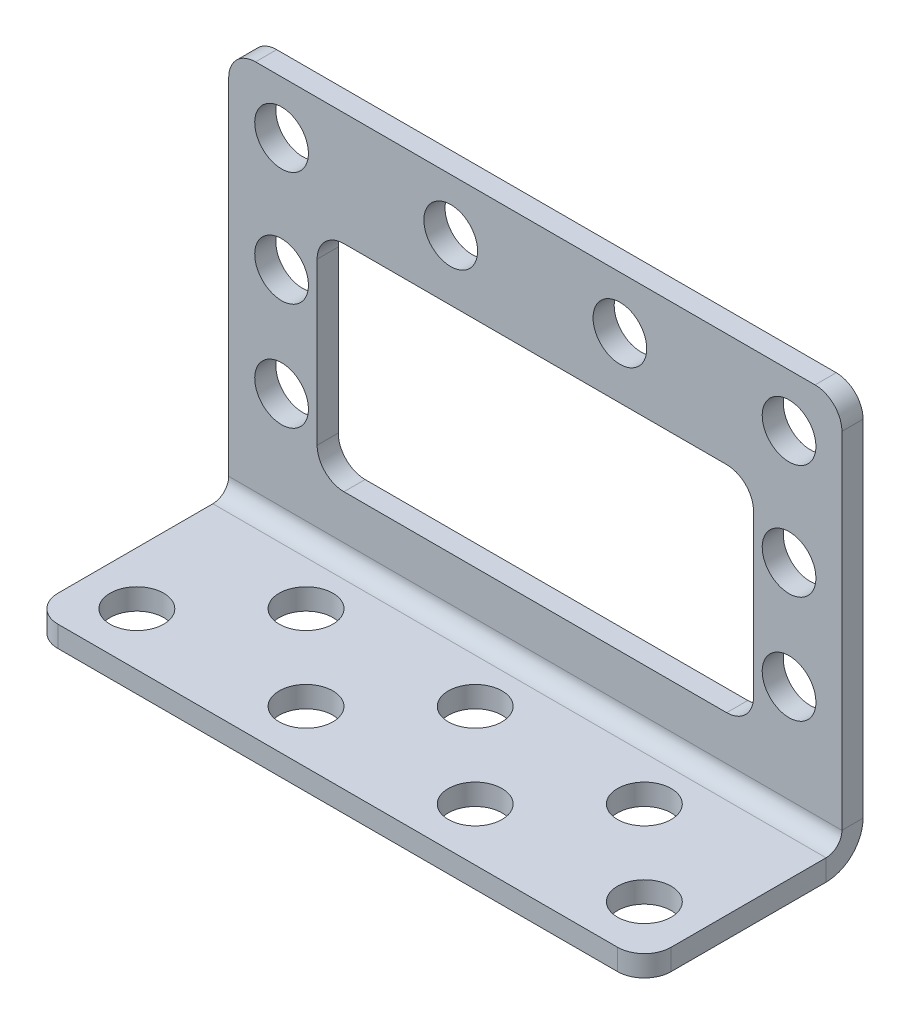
ISO-10303-21;
HEADER;
FILE_DESCRIPTION(('STEP AP214'),'2;1');
FILE_NAME('part.step','',(''),(''),'','','');
FILE_SCHEMA(('AUTOMOTIVE_DESIGN { 1 0 10303 214 1 1 1 1 }'));
ENDSEC;
DATA;
#1=APPLICATION_CONTEXT('core data for automotive mechanical design processes');
#2=APPLICATION_PROTOCOL_DEFINITION('international standard','automotive_design',2000,#1);
#3=PRODUCT_CONTEXT('',#1,'mechanical');
#4=PRODUCT('Part','Part','',(#3));
#5=PRODUCT_RELATED_PRODUCT_CATEGORY('part','',(#4));
#6=PRODUCT_DEFINITION_FORMATION('','',#4);
#7=PRODUCT_DEFINITION_CONTEXT('part definition',#1,'design');
#8=PRODUCT_DEFINITION('design','',#6,#7);
#9=PRODUCT_DEFINITION_SHAPE('','',#8);
#10=(LENGTH_UNIT() NAMED_UNIT(*) SI_UNIT(.MILLI.,.METRE.));
#11=(NAMED_UNIT(*) PLANE_ANGLE_UNIT() SI_UNIT($,.RADIAN.));
#12=(NAMED_UNIT(*) SI_UNIT($,.STERADIAN.) SOLID_ANGLE_UNIT());
#13=UNCERTAINTY_MEASURE_WITH_UNIT(LENGTH_MEASURE(1.E-05),#10,'distance_accuracy_value','');
#14=(GEOMETRIC_REPRESENTATION_CONTEXT(3) GLOBAL_UNCERTAINTY_ASSIGNED_CONTEXT((#13)) GLOBAL_UNIT_ASSIGNED_CONTEXT((#10,
#11,#12)) REPRESENTATION_CONTEXT('',''));
#15=CARTESIAN_POINT('',(0.,0.,0.));
#16=DIRECTION('',(0.,0.,1.));
#17=DIRECTION('',(1.,0.,0.));
#18=AXIS2_PLACEMENT_3D('',#15,#16,#17);
#19=CARTESIAN_POINT('',(-29.,36.1772040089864,16.7734954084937));
#20=DIRECTION('',(1.,0.,0.));
#21=DIRECTION('',(0.,1.,0.));
#22=AXIS2_PLACEMENT_3D('',#19,#20,#21);
#23=PLANE('',#22);
#24=DIRECTION('',(0.,-1.,0.));
#25=VECTOR('',#24,1.);
#26=CARTESIAN_POINT('',(-29.,36.1772040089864,14.7734954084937));
#27=LINE('',#26,#25);
#28=CARTESIAN_POINT('',(-29.,36.1772040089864,14.7734954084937));
#29=VERTEX_POINT('',#28);
#30=CARTESIAN_POINT('',(-29.,3.50000000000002,14.7734954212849));
#31=VERTEX_POINT('',#30);
#32=EDGE_CURVE('E215',#29,#31,#27,.T.);
#33=ORIENTED_EDGE('',*,*,#32,.T.);
#34=DIRECTION('',(0.,0.,1.));
#35=VECTOR('',#34,1.);
#36=CARTESIAN_POINT('',(-29.,3.50000000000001,16.7734954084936));
#37=LINE('',#36,#35);
#38=CARTESIAN_POINT('',(-29.,3.50000000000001,16.7734954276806));
#39=VERTEX_POINT('',#38);
#40=EDGE_CURVE('E187',#31,#39,#37,.T.);
#41=ORIENTED_EDGE('',*,*,#40,.T.);
#42=DIRECTION('',(0.,-1.,0.));
#43=VECTOR('',#42,1.);
#44=CARTESIAN_POINT('',(-29.,36.1772040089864,16.7734954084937));
#45=LINE('',#44,#43);
#46=CARTESIAN_POINT('',(-29.,36.1772040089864,16.7734954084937));
#47=VERTEX_POINT('',#46);
#48=EDGE_CURVE('E46',#47,#39,#45,.T.);
#49=ORIENTED_EDGE('',*,*,#48,.F.);
#50=DIRECTION('',(0.,0.,-1.));
#51=VECTOR('',#50,1.);
#52=CARTESIAN_POINT('',(-29.,36.1772040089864,16.7734954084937));
#53=LINE('',#52,#51);
#54=EDGE_CURVE('E212',#47,#29,#53,.T.);
#55=ORIENTED_EDGE('',*,*,#54,.T.);
#56=EDGE_LOOP('',(#33,#41,#49,#55));
#57=FACE_BOUND('',#56,.T.);
#58=ADVANCED_FACE('F42',(#57),#23,.F.);
#59=CARTESIAN_POINT('',(29.,36.1772040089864,16.7734954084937));
#60=DIRECTION('',(-1.,0.,0.));
#61=DIRECTION('',(0.,-1.,0.));
#62=AXIS2_PLACEMENT_3D('',#59,#60,#61);
#63=PLANE('',#62);
#64=DIRECTION('',(0.,1.,0.));
#65=VECTOR('',#64,1.);
#66=CARTESIAN_POINT('',(29.,36.1772040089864,16.7734954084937));
#67=LINE('',#66,#65);
#68=CARTESIAN_POINT('',(29.,3.50000000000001,16.7734954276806));
#69=VERTEX_POINT('',#68);
#70=CARTESIAN_POINT('',(29.,36.1772040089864,16.7734954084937));
#71=VERTEX_POINT('',#70);
#72=EDGE_CURVE('E224',#69,#71,#67,.T.);
#73=ORIENTED_EDGE('',*,*,#72,.F.);
#74=DIRECTION('',(0.,0.,-1.));
#75=VECTOR('',#74,1.);
#76=CARTESIAN_POINT('',(29.,3.50000000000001,16.7734954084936));
#77=LINE('',#76,#75);
#78=CARTESIAN_POINT('',(29.,3.50000000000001,14.7734954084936));
#79=VERTEX_POINT('',#78);
#80=EDGE_CURVE('E12',#69,#79,#77,.T.);
#81=ORIENTED_EDGE('',*,*,#80,.T.);
#82=DIRECTION('',(0.,1.,0.));
#83=VECTOR('',#82,1.);
#84=CARTESIAN_POINT('',(29.,36.1772040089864,14.7734954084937));
#85=LINE('',#84,#83);
#86=CARTESIAN_POINT('',(29.,36.1772040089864,14.7734954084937));
#87=VERTEX_POINT('',#86);
#88=EDGE_CURVE('E220',#79,#87,#85,.T.);
#89=ORIENTED_EDGE('',*,*,#88,.T.);
#90=DIRECTION('',(0.,0.,-1.));
#91=VECTOR('',#90,1.);
#92=CARTESIAN_POINT('',(29.,36.1772040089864,16.7734954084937));
#93=LINE('',#92,#91);
#94=EDGE_CURVE('E203',#71,#87,#93,.T.);
#95=ORIENTED_EDGE('',*,*,#94,.F.);
#96=EDGE_LOOP('',(#73,#81,#89,#95));
#97=FACE_BOUND('',#96,.T.);
#98=ADVANCED_FACE('F44',(#97),#63,.F.);
#99=CARTESIAN_POINT('',(26.46,-15.0734954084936,16.7734954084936));
#100=DIRECTION('',(0.,0.,-1.));
#101=DIRECTION('',(0.,1.,0.));
#102=AXIS2_PLACEMENT_3D('',#99,#100,#101);
#103=PLANE('',#102);
#104=CARTESIAN_POINT('',(24.,33.7172040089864,16.7734954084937));
#105=DIRECTION('',(0.,0.,1.));
#106=DIRECTION('',(0.,-1.,0.));
#107=AXIS2_PLACEMENT_3D('',#104,#105,#106);
#108=CIRCLE('',#107,2.54);
#109=CARTESIAN_POINT('',(24.,31.1772040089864,16.7734954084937));
#110=VERTEX_POINT('',#109);
#111=EDGE_CURVE('E293',#110,#110,#108,.T.);
#112=ORIENTED_EDGE('',*,*,#111,.F.);
#113=EDGE_LOOP('',(#112));
#114=FACE_BOUND('',#113,.T.);
#115=CARTESIAN_POINT('',(-24.,12.7665045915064,16.7734954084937));
#116=DIRECTION('',(0.,0.,1.));
#117=DIRECTION('',(0.,-1.,0.));
#118=AXIS2_PLACEMENT_3D('',#115,#116,#117);
#119=CIRCLE('',#118,2.54);
#120=CARTESIAN_POINT('',(-24.,10.2265045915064,16.7734954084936));
#121=VERTEX_POINT('',#120);
#122=EDGE_CURVE('E297',#121,#121,#119,.T.);
#123=ORIENTED_EDGE('',*,*,#122,.F.);
#124=EDGE_LOOP('',(#123));
#125=FACE_BOUND('',#124,.T.);
#126=CARTESIAN_POINT('',(-24.,22.9265045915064,16.7734954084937));
#127=DIRECTION('',(0.,0.,1.));
#128=DIRECTION('',(0.,-1.,0.));
#129=AXIS2_PLACEMENT_3D('',#126,#127,#128);
#130=CIRCLE('',#129,2.54);
#131=CARTESIAN_POINT('',(-24.,20.3865045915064,16.7734954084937));
#132=VERTEX_POINT('',#131);
#133=EDGE_CURVE('E301',#132,#132,#130,.T.);
#134=ORIENTED_EDGE('',*,*,#133,.F.);
#135=EDGE_LOOP('',(#134));
#136=FACE_BOUND('',#135,.T.);
#137=CARTESIAN_POINT('',(-8.,33.7172040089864,16.7734954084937));
#138=DIRECTION('',(0.,0.,1.));
#139=DIRECTION('',(0.,-1.,0.));
#140=AXIS2_PLACEMENT_3D('',#137,#138,#139);
#141=CIRCLE('',#140,2.54);
#142=CARTESIAN_POINT('',(-8.,31.1772040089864,16.7734954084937));
#143=VERTEX_POINT('',#142);
#144=EDGE_CURVE('E305',#143,#143,#141,.T.);
#145=ORIENTED_EDGE('',*,*,#144,.F.);
#146=EDGE_LOOP('',(#145));
#147=FACE_BOUND('',#146,.T.);
#148=CARTESIAN_POINT('',(-18.0975,25.4665045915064,16.7734954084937));
#149=DIRECTION('',(0.,0.,1.));
#150=DIRECTION('',(0.,1.,0.));
#151=AXIS2_PLACEMENT_3D('',#148,#149,#150);
#152=CIRCLE('',#151,2.54);
#153=CARTESIAN_POINT('',(-18.0975,28.0065045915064,16.7734954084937));
#154=VERTEX_POINT('',#153);
#155=CARTESIAN_POINT('',(-20.6375,25.4665045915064,16.7734954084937));
#156=VERTEX_POINT('',#155);
#157=EDGE_CURVE('E310',#154,#156,#152,.T.);
#158=ORIENTED_EDGE('',*,*,#157,.F.);
#159=DIRECTION('',(-1.,0.,0.));
#160=VECTOR('',#159,1.);
#161=CARTESIAN_POINT('',(-18.0975,28.0065045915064,16.7734954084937));
#162=LINE('',#161,#160);
#163=CARTESIAN_POINT('',(18.0975,28.0065045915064,16.7734954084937));
#164=VERTEX_POINT('',#163);
#165=EDGE_CURVE('E379',#164,#154,#162,.T.);
#166=ORIENTED_EDGE('',*,*,#165,.F.);
#167=CARTESIAN_POINT('',(18.0975,25.4665045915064,16.7734954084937));
#168=DIRECTION('',(0.,0.,1.));
#169=DIRECTION('',(0.,-1.,0.));
#170=AXIS2_PLACEMENT_3D('',#167,#168,#169);
#171=CIRCLE('',#170,2.54);
#172=CARTESIAN_POINT('',(20.6375,25.4665045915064,16.7734954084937));
#173=VERTEX_POINT('',#172);
#174=EDGE_CURVE('E377',#173,#164,#171,.T.);
#175=ORIENTED_EDGE('',*,*,#174,.F.);
#176=DIRECTION('',(0.,1.,0.));
#177=VECTOR('',#176,1.);
#178=CARTESIAN_POINT('',(20.6375,10.2265045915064,16.7734954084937));
#179=LINE('',#178,#177);
#180=CARTESIAN_POINT('',(20.6375,10.2265045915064,16.7734954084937));
#181=VERTEX_POINT('',#180);
#182=EDGE_CURVE('E375',#181,#173,#179,.T.);
#183=ORIENTED_EDGE('',*,*,#182,.F.);
#184=CARTESIAN_POINT('',(18.0975,10.2265045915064,16.7734954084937));
#185=DIRECTION('',(0.,0.,1.));
#186=DIRECTION('',(0.,-1.,0.));
#187=AXIS2_PLACEMENT_3D('',#184,#185,#186);
#188=CIRCLE('',#187,2.54);
#189=CARTESIAN_POINT('',(18.0975,7.68650459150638,16.7734954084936));
#190=VERTEX_POINT('',#189);
#191=EDGE_CURVE('E373',#190,#181,#188,.T.);
#192=ORIENTED_EDGE('',*,*,#191,.F.);
#193=DIRECTION('',(1.,0.,0.));
#194=VECTOR('',#193,1.);
#195=CARTESIAN_POINT('',(-18.0975,7.68650459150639,16.7734954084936));
#196=LINE('',#195,#194);
#197=CARTESIAN_POINT('',(-18.0975,7.68650459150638,16.7734954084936));
#198=VERTEX_POINT('',#197);
#199=EDGE_CURVE('E371',#198,#190,#196,.T.);
#200=ORIENTED_EDGE('',*,*,#199,.F.);
#201=CARTESIAN_POINT('',(-18.0975,10.2265045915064,16.7734954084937));
#202=DIRECTION('',(0.,0.,1.));
#203=DIRECTION('',(0.,1.,0.));
#204=AXIS2_PLACEMENT_3D('',#201,#202,#203);
#205=CIRCLE('',#204,2.54);
#206=CARTESIAN_POINT('',(-20.6375,10.2265045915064,16.7734954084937));
#207=VERTEX_POINT('',#206);
#208=EDGE_CURVE('E369',#207,#198,#205,.T.);
#209=ORIENTED_EDGE('',*,*,#208,.F.);
#210=DIRECTION('',(0.,-1.,0.));
#211=VECTOR('',#210,1.);
#212=CARTESIAN_POINT('',(-20.6375,10.2265045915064,16.7734954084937));
#213=LINE('',#212,#211);
#214=EDGE_CURVE('E366',#156,#207,#213,.T.);
#215=ORIENTED_EDGE('',*,*,#214,.F.);
#216=EDGE_LOOP('',(#158,#166,#175,#183,#192,#200,#209,#215));
#217=FACE_BOUND('',#216,.T.);
#218=CARTESIAN_POINT('',(8.,33.7172040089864,16.7734954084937));
#219=DIRECTION('',(0.,0.,1.));
#220=DIRECTION('',(0.,-1.,0.));
#221=AXIS2_PLACEMENT_3D('',#218,#219,#220);
#222=CIRCLE('',#221,2.54);
#223=CARTESIAN_POINT('',(8.,31.1772040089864,16.7734954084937));
#224=VERTEX_POINT('',#223);
#225=EDGE_CURVE('E314',#224,#224,#222,.T.);
#226=ORIENTED_EDGE('',*,*,#225,.F.);
#227=EDGE_LOOP('',(#226));
#228=FACE_BOUND('',#227,.T.);
#229=CARTESIAN_POINT('',(24.,22.9265045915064,16.7734954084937));
#230=DIRECTION('',(0.,0.,1.));
#231=DIRECTION('',(0.,-1.,0.));
#232=AXIS2_PLACEMENT_3D('',#229,#230,#231);
#233=CIRCLE('',#232,2.54);
#234=CARTESIAN_POINT('',(24.,20.3865045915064,16.7734954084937));
#235=VERTEX_POINT('',#234);
#236=EDGE_CURVE('E318',#235,#235,#233,.T.);
#237=ORIENTED_EDGE('',*,*,#236,.F.);
#238=EDGE_LOOP('',(#237));
#239=FACE_BOUND('',#238,.T.);
#240=CARTESIAN_POINT('',(24.,12.7665045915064,16.7734954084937));
#241=DIRECTION('',(0.,0.,1.));
#242=DIRECTION('',(0.,-1.,0.));
#243=AXIS2_PLACEMENT_3D('',#240,#241,#242);
#244=CIRCLE('',#243,2.54);
#245=CARTESIAN_POINT('',(24.,10.2265045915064,16.7734954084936));
#246=VERTEX_POINT('',#245);
#247=EDGE_CURVE('E322',#246,#246,#244,.T.);
#248=ORIENTED_EDGE('',*,*,#247,.F.);
#249=EDGE_LOOP('',(#248));
#250=FACE_BOUND('',#249,.T.);
#251=CARTESIAN_POINT('',(-24.,33.7172040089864,16.7734954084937));
#252=DIRECTION('',(0.,0.,1.));
#253=DIRECTION('',(0.,-1.,0.));
#254=AXIS2_PLACEMENT_3D('',#251,#252,#253);
#255=CIRCLE('',#254,2.54);
#256=CARTESIAN_POINT('',(-24.,31.1772040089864,16.7734954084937));
#257=VERTEX_POINT('',#256);
#258=EDGE_CURVE('E325',#257,#257,#255,.T.);
#259=ORIENTED_EDGE('',*,*,#258,.F.);
#260=EDGE_LOOP('',(#259));
#261=FACE_BOUND('',#260,.T.);
#262=ORIENTED_EDGE('',*,*,#48,.T.);
#263=DIRECTION('',(1.,0.,0.));
#264=VECTOR('',#263,1.);
#265=CARTESIAN_POINT('',(26.46,3.50000000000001,16.7734954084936));
#266=LINE('',#265,#264);
#267=EDGE_CURVE('E197',#39,#69,#266,.T.);
#268=ORIENTED_EDGE('',*,*,#267,.T.);
#269=ORIENTED_EDGE('',*,*,#72,.T.);
#270=CARTESIAN_POINT('',(26.46,36.1772040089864,16.7734954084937));
#271=DIRECTION('',(0.,0.,1.));
#272=DIRECTION('',(0.,-1.,0.));
#273=AXIS2_PLACEMENT_3D('',#270,#271,#272);
#274=CIRCLE('',#273,2.54);
#275=CARTESIAN_POINT('',(26.46,38.7172040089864,16.7734954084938));
#276=VERTEX_POINT('',#275);
#277=EDGE_CURVE('E226',#71,#276,#274,.T.);
#278=ORIENTED_EDGE('',*,*,#277,.T.);
#279=DIRECTION('',(-1.,0.,0.));
#280=VECTOR('',#279,1.);
#281=CARTESIAN_POINT('',(-26.46,38.7172040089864,16.7734954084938));
#282=LINE('',#281,#280);
#283=CARTESIAN_POINT('',(-26.46,38.7172040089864,16.7734954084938));
#284=VERTEX_POINT('',#283);
#285=EDGE_CURVE('E228',#276,#284,#282,.T.);
#286=ORIENTED_EDGE('',*,*,#285,.T.);
#287=CARTESIAN_POINT('',(-26.46,36.1772040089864,16.7734954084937));
#288=DIRECTION('',(0.,0.,1.));
#289=DIRECTION('',(0.,1.,0.));
#290=AXIS2_PLACEMENT_3D('',#287,#288,#289);
#291=CIRCLE('',#290,2.54);
#292=EDGE_CURVE('E208',#284,#47,#291,.T.);
#293=ORIENTED_EDGE('',*,*,#292,.T.);
#294=EDGE_LOOP('',(#262,#268,#269,#278,#286,#293));
#295=FACE_BOUND('',#294,.T.);
#296=ADVANCED_FACE('F206',(#114,#125,#136,#147,#217,#228,#239,#250,#261,#295),#103,.F.);
#297=CARTESIAN_POINT('',(26.46,-15.0734954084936,14.7734954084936));
#298=DIRECTION('',(0.,0.,-1.));
#299=DIRECTION('',(0.,1.,0.));
#300=AXIS2_PLACEMENT_3D('',#297,#298,#299);
#301=PLANE('',#300);
#302=DIRECTION('',(1.,0.,0.));
#303=VECTOR('',#302,1.);
#304=CARTESIAN_POINT('',(26.46,3.50000000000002,14.7734954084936));
#305=LINE('',#304,#303);
#306=EDGE_CURVE('E51',#31,#79,#305,.T.);
#307=ORIENTED_EDGE('',*,*,#306,.F.);
#308=ORIENTED_EDGE('',*,*,#32,.F.);
#309=CARTESIAN_POINT('',(-26.46,36.1772040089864,14.7734954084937));
#310=DIRECTION('',(0.,0.,1.));
#311=DIRECTION('',(0.,1.,0.));
#312=AXIS2_PLACEMENT_3D('',#309,#310,#311);
#313=CIRCLE('',#312,2.54);
#314=CARTESIAN_POINT('',(-26.46,38.7172040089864,14.7734954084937));
#315=VERTEX_POINT('',#314);
#316=EDGE_CURVE('E225',#315,#29,#313,.T.);
#317=ORIENTED_EDGE('',*,*,#316,.F.);
#318=DIRECTION('',(-1.,0.,0.));
#319=VECTOR('',#318,1.);
#320=CARTESIAN_POINT('',(-26.46,38.7172040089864,14.7734954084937));
#321=LINE('',#320,#319);
#322=CARTESIAN_POINT('',(26.46,38.7172040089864,14.7734954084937));
#323=VERTEX_POINT('',#322);
#324=EDGE_CURVE('E238',#323,#315,#321,.T.);
#325=ORIENTED_EDGE('',*,*,#324,.F.);
#326=CARTESIAN_POINT('',(26.46,36.1772040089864,14.7734954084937));
#327=DIRECTION('',(0.,0.,1.));
#328=DIRECTION('',(0.,-1.,0.));
#329=AXIS2_PLACEMENT_3D('',#326,#327,#328);
#330=CIRCLE('',#329,2.54);
#331=EDGE_CURVE('E222',#87,#323,#330,.T.);
#332=ORIENTED_EDGE('',*,*,#331,.F.);
#333=ORIENTED_EDGE('',*,*,#88,.F.);
#334=EDGE_LOOP('',(#307,#308,#317,#325,#332,#333));
#335=FACE_BOUND('',#334,.T.);
#336=CARTESIAN_POINT('',(-24.,33.7172040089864,14.7734954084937));
#337=DIRECTION('',(0.,0.,1.));
#338=DIRECTION('',(0.,-1.,0.));
#339=AXIS2_PLACEMENT_3D('',#336,#337,#338);
#340=CIRCLE('',#339,2.54);
#341=CARTESIAN_POINT('',(-24.,31.1772040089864,14.7734954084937));
#342=VERTEX_POINT('',#341);
#343=EDGE_CURVE('E328',#342,#342,#340,.T.);
#344=ORIENTED_EDGE('',*,*,#343,.T.);
#345=EDGE_LOOP('',(#344));
#346=FACE_BOUND('',#345,.T.);
#347=CARTESIAN_POINT('',(24.,12.7665045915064,14.7734954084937));
#348=DIRECTION('',(0.,0.,1.));
#349=DIRECTION('',(0.,-1.,0.));
#350=AXIS2_PLACEMENT_3D('',#347,#348,#349);
#351=CIRCLE('',#350,2.54);
#352=CARTESIAN_POINT('',(24.,10.2265045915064,14.7734954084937));
#353=VERTEX_POINT('',#352);
#354=EDGE_CURVE('E339',#353,#353,#351,.T.);
#355=ORIENTED_EDGE('',*,*,#354,.T.);
#356=EDGE_LOOP('',(#355));
#357=FACE_BOUND('',#356,.T.);
#358=CARTESIAN_POINT('',(24.,22.9265045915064,14.7734954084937));
#359=DIRECTION('',(0.,0.,1.));
#360=DIRECTION('',(0.,-1.,0.));
#361=AXIS2_PLACEMENT_3D('',#358,#359,#360);
#362=CIRCLE('',#361,2.54);
#363=CARTESIAN_POINT('',(24.,20.3865045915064,14.7734954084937));
#364=VERTEX_POINT('',#363);
#365=EDGE_CURVE('E346',#364,#364,#362,.T.);
#366=ORIENTED_EDGE('',*,*,#365,.T.);
#367=EDGE_LOOP('',(#366));
#368=FACE_BOUND('',#367,.T.);
#369=CARTESIAN_POINT('',(8.,33.7172040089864,14.7734954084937));
#370=DIRECTION('',(0.,0.,1.));
#371=DIRECTION('',(0.,-1.,0.));
#372=AXIS2_PLACEMENT_3D('',#369,#370,#371);
#373=CIRCLE('',#372,2.54);
#374=CARTESIAN_POINT('',(8.,31.1772040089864,14.7734954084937));
#375=VERTEX_POINT('',#374);
#376=EDGE_CURVE('E358',#375,#375,#373,.T.);
#377=ORIENTED_EDGE('',*,*,#376,.T.);
#378=EDGE_LOOP('',(#377));
#379=FACE_BOUND('',#378,.T.);
#380=DIRECTION('',(-1.,0.,0.));
#381=VECTOR('',#380,1.);
#382=CARTESIAN_POINT('',(-18.0975,28.0065045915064,14.7734954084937));
#383=LINE('',#382,#381);
#384=CARTESIAN_POINT('',(18.0975,28.0065045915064,14.7734954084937));
#385=VERTEX_POINT('',#384);
#386=CARTESIAN_POINT('',(-18.0975,28.0065045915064,14.7734954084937));
#387=VERTEX_POINT('',#386);
#388=EDGE_CURVE('E367',#385,#387,#383,.T.);
#389=ORIENTED_EDGE('',*,*,#388,.T.);
#390=CARTESIAN_POINT('',(-18.0975,25.4665045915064,14.7734954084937));
#391=DIRECTION('',(0.,0.,1.));
#392=DIRECTION('',(0.,1.,0.));
#393=AXIS2_PLACEMENT_3D('',#390,#391,#392);
#394=CIRCLE('',#393,2.54);
#395=CARTESIAN_POINT('',(-20.6375,25.4665045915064,14.7734954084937));
#396=VERTEX_POINT('',#395);
#397=EDGE_CURVE('E362',#387,#396,#394,.T.);
#398=ORIENTED_EDGE('',*,*,#397,.T.);
#399=DIRECTION('',(0.,-1.,0.));
#400=VECTOR('',#399,1.);
#401=CARTESIAN_POINT('',(-20.6375,10.2265045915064,14.7734954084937));
#402=LINE('',#401,#400);
#403=CARTESIAN_POINT('',(-20.6375,10.2265045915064,14.7734954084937));
#404=VERTEX_POINT('',#403);
#405=EDGE_CURVE('E384',#396,#404,#402,.T.);
#406=ORIENTED_EDGE('',*,*,#405,.T.);
#407=CARTESIAN_POINT('',(-18.0975,10.2265045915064,14.7734954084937));
#408=DIRECTION('',(0.,0.,1.));
#409=DIRECTION('',(0.,1.,0.));
#410=AXIS2_PLACEMENT_3D('',#407,#408,#409);
#411=CIRCLE('',#410,2.54);
#412=CARTESIAN_POINT('',(-18.0975,7.68650459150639,14.7734954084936));
#413=VERTEX_POINT('',#412);
#414=EDGE_CURVE('E387',#404,#413,#411,.T.);
#415=ORIENTED_EDGE('',*,*,#414,.T.);
#416=DIRECTION('',(1.,0.,0.));
#417=VECTOR('',#416,1.);
#418=CARTESIAN_POINT('',(-18.0975,7.68650459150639,14.7734954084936));
#419=LINE('',#418,#417);
#420=CARTESIAN_POINT('',(18.0975,7.68650459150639,14.7734954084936));
#421=VERTEX_POINT('',#420);
#422=EDGE_CURVE('E390',#413,#421,#419,.T.);
#423=ORIENTED_EDGE('',*,*,#422,.T.);
#424=CARTESIAN_POINT('',(18.0975,10.2265045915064,14.7734954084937));
#425=DIRECTION('',(0.,0.,1.));
#426=DIRECTION('',(0.,-1.,0.));
#427=AXIS2_PLACEMENT_3D('',#424,#425,#426);
#428=CIRCLE('',#427,2.54);
#429=CARTESIAN_POINT('',(20.6375,10.2265045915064,14.7734954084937));
#430=VERTEX_POINT('',#429);
#431=EDGE_CURVE('E393',#421,#430,#428,.T.);
#432=ORIENTED_EDGE('',*,*,#431,.T.);
#433=DIRECTION('',(0.,1.,0.));
#434=VECTOR('',#433,1.);
#435=CARTESIAN_POINT('',(20.6375,10.2265045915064,14.7734954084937));
#436=LINE('',#435,#434);
#437=CARTESIAN_POINT('',(20.6375,25.4665045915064,14.7734954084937));
#438=VERTEX_POINT('',#437);
#439=EDGE_CURVE('E396',#430,#438,#436,.T.);
#440=ORIENTED_EDGE('',*,*,#439,.T.);
#441=CARTESIAN_POINT('',(18.0975,25.4665045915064,14.7734954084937));
#442=DIRECTION('',(0.,0.,1.));
#443=DIRECTION('',(0.,-1.,0.));
#444=AXIS2_PLACEMENT_3D('',#441,#442,#443);
#445=CIRCLE('',#444,2.54);
#446=EDGE_CURVE('E399',#438,#385,#445,.T.);
#447=ORIENTED_EDGE('',*,*,#446,.T.);
#448=EDGE_LOOP('',(#389,#398,#406,#415,#423,#432,#440,#447));
#449=FACE_BOUND('',#448,.T.);
#450=CARTESIAN_POINT('',(-8.,33.7172040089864,14.7734954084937));
#451=DIRECTION('',(0.,0.,1.));
#452=DIRECTION('',(0.,-1.,0.));
#453=AXIS2_PLACEMENT_3D('',#450,#451,#452);
#454=CIRCLE('',#453,2.54);
#455=CARTESIAN_POINT('',(-8.,31.1772040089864,14.7734954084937));
#456=VERTEX_POINT('',#455);
#457=EDGE_CURVE('E354',#456,#456,#454,.T.);
#458=ORIENTED_EDGE('',*,*,#457,.T.);
#459=EDGE_LOOP('',(#458));
#460=FACE_BOUND('',#459,.T.);
#461=CARTESIAN_POINT('',(-24.,22.9265045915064,14.7734954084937));
#462=DIRECTION('',(0.,0.,1.));
#463=DIRECTION('',(0.,-1.,0.));
#464=AXIS2_PLACEMENT_3D('',#461,#462,#463);
#465=CIRCLE('',#464,2.54);
#466=CARTESIAN_POINT('',(-24.,20.3865045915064,14.7734954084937));
#467=VERTEX_POINT('',#466);
#468=EDGE_CURVE('E350',#467,#467,#465,.T.);
#469=ORIENTED_EDGE('',*,*,#468,.T.);
#470=EDGE_LOOP('',(#469));
#471=FACE_BOUND('',#470,.T.);
#472=CARTESIAN_POINT('',(-24.,12.7665045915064,14.7734954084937));
#473=DIRECTION('',(0.,0.,1.));
#474=DIRECTION('',(0.,-1.,0.));
#475=AXIS2_PLACEMENT_3D('',#472,#473,#474);
#476=CIRCLE('',#475,2.54);
#477=CARTESIAN_POINT('',(-24.,10.2265045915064,14.7734954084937));
#478=VERTEX_POINT('',#477);
#479=EDGE_CURVE('E342',#478,#478,#476,.T.);
#480=ORIENTED_EDGE('',*,*,#479,.T.);
#481=EDGE_LOOP('',(#480));
#482=FACE_BOUND('',#481,.T.);
#483=CARTESIAN_POINT('',(24.,33.7172040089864,14.7734954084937));
#484=DIRECTION('',(0.,0.,1.));
#485=DIRECTION('',(0.,-1.,0.));
#486=AXIS2_PLACEMENT_3D('',#483,#484,#485);
#487=CIRCLE('',#486,2.54);
#488=CARTESIAN_POINT('',(24.,31.1772040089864,14.7734954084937));
#489=VERTEX_POINT('',#488);
#490=EDGE_CURVE('E327',#489,#489,#487,.T.);
#491=ORIENTED_EDGE('',*,*,#490,.T.);
#492=EDGE_LOOP('',(#491));
#493=FACE_BOUND('',#492,.T.);
#494=ADVANCED_FACE('F255',(#335,#346,#357,#368,#379,#449,#460,#471,#482,#493),#301,.T.);
#495=CARTESIAN_POINT('',(26.46,36.1772040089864,16.7734954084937));
#496=DIRECTION('',(0.,0.,-1.));
#497=DIRECTION('',(0.,1.,0.));
#498=AXIS2_PLACEMENT_3D('',#495,#496,#497);
#499=CYLINDRICAL_SURFACE('',#498,2.54);
#500=ORIENTED_EDGE('',*,*,#331,.T.);
#501=DIRECTION('',(0.,0.,-1.));
#502=VECTOR('',#501,1.);
#503=CARTESIAN_POINT('',(26.46,38.7172040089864,16.7734954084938));
#504=LINE('',#503,#502);
#505=EDGE_CURVE('E245',#276,#323,#504,.T.);
#506=ORIENTED_EDGE('',*,*,#505,.F.);
#507=ORIENTED_EDGE('',*,*,#277,.F.);
#508=ORIENTED_EDGE('',*,*,#94,.T.);
#509=EDGE_LOOP('',(#500,#506,#507,#508));
#510=FACE_BOUND('',#509,.T.);
#511=ADVANCED_FACE('F250',(#510),#499,.T.);
#512=CARTESIAN_POINT('',(-26.46,38.7172040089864,16.7734954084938));
#513=DIRECTION('',(0.,-1.,0.));
#514=DIRECTION('',(1.,0.,0.));
#515=AXIS2_PLACEMENT_3D('',#512,#513,#514);
#516=PLANE('',#515);
#517=ORIENTED_EDGE('',*,*,#324,.T.);
#518=DIRECTION('',(0.,0.,-1.));
#519=VECTOR('',#518,1.);
#520=CARTESIAN_POINT('',(-26.46,38.7172040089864,16.7734954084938));
#521=LINE('',#520,#519);
#522=EDGE_CURVE('E242',#284,#315,#521,.T.);
#523=ORIENTED_EDGE('',*,*,#522,.F.);
#524=ORIENTED_EDGE('',*,*,#285,.F.);
#525=ORIENTED_EDGE('',*,*,#505,.T.);
#526=EDGE_LOOP('',(#517,#523,#524,#525));
#527=FACE_BOUND('',#526,.T.);
#528=ADVANCED_FACE('F260',(#527),#516,.F.);
#529=CARTESIAN_POINT('',(-26.46,36.1772040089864,16.7734954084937));
#530=DIRECTION('',(0.,0.,-1.));
#531=DIRECTION('',(0.,1.,0.));
#532=AXIS2_PLACEMENT_3D('',#529,#530,#531);
#533=CYLINDRICAL_SURFACE('',#532,2.54);
#534=ORIENTED_EDGE('',*,*,#316,.T.);
#535=ORIENTED_EDGE('',*,*,#54,.F.);
#536=ORIENTED_EDGE('',*,*,#292,.F.);
#537=ORIENTED_EDGE('',*,*,#522,.T.);
#538=EDGE_LOOP('',(#534,#535,#536,#537));
#539=FACE_BOUND('',#538,.T.);
#540=ADVANCED_FACE('F263',(#539),#533,.T.);
#541=CARTESIAN_POINT('',(-18.0975,25.4665045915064,16.7734954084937));
#542=DIRECTION('',(0.,0.,-1.));
#543=DIRECTION('',(0.,1.,0.));
#544=AXIS2_PLACEMENT_3D('',#541,#542,#543);
#545=CYLINDRICAL_SURFACE('',#544,2.54);
#546=ORIENTED_EDGE('',*,*,#397,.F.);
#547=DIRECTION('',(0.,0.,-1.));
#548=VECTOR('',#547,1.);
#549=CARTESIAN_POINT('',(-18.0975,28.0065045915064,16.7734954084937));
#550=LINE('',#549,#548);
#551=EDGE_CURVE('E381',#154,#387,#550,.T.);
#552=ORIENTED_EDGE('',*,*,#551,.F.);
#553=ORIENTED_EDGE('',*,*,#157,.T.);
#554=DIRECTION('',(0.,0.,-1.));
#555=VECTOR('',#554,1.);
#556=CARTESIAN_POINT('',(-20.6375,25.4665045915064,16.7734954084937));
#557=LINE('',#556,#555);
#558=EDGE_CURVE('E223',#156,#396,#557,.T.);
#559=ORIENTED_EDGE('',*,*,#558,.T.);
#560=EDGE_LOOP('',(#546,#552,#553,#559));
#561=FACE_BOUND('',#560,.T.);
#562=ADVANCED_FACE('F265',(#561),#545,.F.);
#563=CARTESIAN_POINT('',(-20.6375,10.2265045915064,16.7734954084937));
#564=DIRECTION('',(1.,0.,0.));
#565=DIRECTION('',(0.,1.,0.));
#566=AXIS2_PLACEMENT_3D('',#563,#564,#565);
#567=PLANE('',#566);
#568=ORIENTED_EDGE('',*,*,#405,.F.);
#569=ORIENTED_EDGE('',*,*,#558,.F.);
#570=ORIENTED_EDGE('',*,*,#214,.T.);
#571=DIRECTION('',(0.,0.,-1.));
#572=VECTOR('',#571,1.);
#573=CARTESIAN_POINT('',(-20.6375,10.2265045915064,16.7734954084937));
#574=LINE('',#573,#572);
#575=EDGE_CURVE('E414',#207,#404,#574,.T.);
#576=ORIENTED_EDGE('',*,*,#575,.T.);
#577=EDGE_LOOP('',(#568,#569,#570,#576));
#578=FACE_BOUND('',#577,.T.);
#579=ADVANCED_FACE('F271',(#578),#567,.T.);
#580=CARTESIAN_POINT('',(-18.0975,10.2265045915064,16.7734954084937));
#581=DIRECTION('',(0.,0.,-1.));
#582=DIRECTION('',(0.,1.,0.));
#583=AXIS2_PLACEMENT_3D('',#580,#581,#582);
#584=CYLINDRICAL_SURFACE('',#583,2.54);
#585=ORIENTED_EDGE('',*,*,#414,.F.);
#586=ORIENTED_EDGE('',*,*,#575,.F.);
#587=ORIENTED_EDGE('',*,*,#208,.T.);
#588=DIRECTION('',(0.,0.,-1.));
#589=VECTOR('',#588,1.);
#590=CARTESIAN_POINT('',(-18.0975,7.68650459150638,16.7734954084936));
#591=LINE('',#590,#589);
#592=EDGE_CURVE('E413',#198,#413,#591,.T.);
#593=ORIENTED_EDGE('',*,*,#592,.T.);
#594=EDGE_LOOP('',(#585,#586,#587,#593));
#595=FACE_BOUND('',#594,.T.);
#596=ADVANCED_FACE('F446',(#595),#584,.F.);
#597=CARTESIAN_POINT('',(-18.0975,7.68650459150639,16.7734954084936));
#598=DIRECTION('',(0.,1.,0.));
#599=DIRECTION('',(-1.,0.,0.));
#600=AXIS2_PLACEMENT_3D('',#597,#598,#599);
#601=PLANE('',#600);
#602=ORIENTED_EDGE('',*,*,#422,.F.);
#603=ORIENTED_EDGE('',*,*,#592,.F.);
#604=ORIENTED_EDGE('',*,*,#199,.T.);
#605=DIRECTION('',(0.,0.,-1.));
#606=VECTOR('',#605,1.);
#607=CARTESIAN_POINT('',(18.0975,7.68650459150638,16.7734954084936));
#608=LINE('',#607,#606);
#609=EDGE_CURVE('E411',#190,#421,#608,.T.);
#610=ORIENTED_EDGE('',*,*,#609,.T.);
#611=EDGE_LOOP('',(#602,#603,#604,#610));
#612=FACE_BOUND('',#611,.T.);
#613=ADVANCED_FACE('F444',(#612),#601,.T.);
#614=CARTESIAN_POINT('',(18.0975,10.2265045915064,16.7734954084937));
#615=DIRECTION('',(0.,0.,-1.));
#616=DIRECTION('',(0.,1.,0.));
#617=AXIS2_PLACEMENT_3D('',#614,#615,#616);
#618=CYLINDRICAL_SURFACE('',#617,2.54);
#619=ORIENTED_EDGE('',*,*,#431,.F.);
#620=ORIENTED_EDGE('',*,*,#609,.F.);
#621=ORIENTED_EDGE('',*,*,#191,.T.);
#622=DIRECTION('',(0.,0.,-1.));
#623=VECTOR('',#622,1.);
#624=CARTESIAN_POINT('',(20.6375,10.2265045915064,16.7734954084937));
#625=LINE('',#624,#623);
#626=EDGE_CURVE('E409',#181,#430,#625,.T.);
#627=ORIENTED_EDGE('',*,*,#626,.T.);
#628=EDGE_LOOP('',(#619,#620,#621,#627));
#629=FACE_BOUND('',#628,.T.);
#630=ADVANCED_FACE('F437',(#629),#618,.F.);
#631=CARTESIAN_POINT('',(20.6375,10.2265045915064,16.7734954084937));
#632=DIRECTION('',(-1.,0.,0.));
#633=DIRECTION('',(0.,-1.,0.));
#634=AXIS2_PLACEMENT_3D('',#631,#632,#633);
#635=PLANE('',#634);
#636=ORIENTED_EDGE('',*,*,#439,.F.);
#637=ORIENTED_EDGE('',*,*,#626,.F.);
#638=ORIENTED_EDGE('',*,*,#182,.T.);
#639=DIRECTION('',(0.,0.,-1.));
#640=VECTOR('',#639,1.);
#641=CARTESIAN_POINT('',(20.6375,25.4665045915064,16.7734954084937));
#642=LINE('',#641,#640);
#643=EDGE_CURVE('E407',#173,#438,#642,.T.);
#644=ORIENTED_EDGE('',*,*,#643,.T.);
#645=EDGE_LOOP('',(#636,#637,#638,#644));
#646=FACE_BOUND('',#645,.T.);
#647=ADVANCED_FACE('F433',(#646),#635,.T.);
#648=CARTESIAN_POINT('',(18.0975,25.4665045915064,16.7734954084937));
#649=DIRECTION('',(0.,0.,-1.));
#650=DIRECTION('',(0.,1.,0.));
#651=AXIS2_PLACEMENT_3D('',#648,#649,#650);
#652=CYLINDRICAL_SURFACE('',#651,2.54);
#653=ORIENTED_EDGE('',*,*,#446,.F.);
#654=ORIENTED_EDGE('',*,*,#643,.F.);
#655=ORIENTED_EDGE('',*,*,#174,.T.);
#656=DIRECTION('',(0.,0.,-1.));
#657=VECTOR('',#656,1.);
#658=CARTESIAN_POINT('',(18.0975,28.0065045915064,16.7734954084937));
#659=LINE('',#658,#657);
#660=EDGE_CURVE('E66',#164,#385,#659,.T.);
#661=ORIENTED_EDGE('',*,*,#660,.T.);
#662=EDGE_LOOP('',(#653,#654,#655,#661));
#663=FACE_BOUND('',#662,.T.);
#664=ADVANCED_FACE('F430',(#663),#652,.F.);
#665=CARTESIAN_POINT('',(-18.0975,28.0065045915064,16.7734954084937));
#666=DIRECTION('',(0.,-1.,0.));
#667=DIRECTION('',(1.,0.,0.));
#668=AXIS2_PLACEMENT_3D('',#665,#666,#667);
#669=PLANE('',#668);
#670=ORIENTED_EDGE('',*,*,#388,.F.);
#671=ORIENTED_EDGE('',*,*,#660,.F.);
#672=ORIENTED_EDGE('',*,*,#165,.T.);
#673=ORIENTED_EDGE('',*,*,#551,.T.);
#674=EDGE_LOOP('',(#670,#671,#672,#673));
#675=FACE_BOUND('',#674,.T.);
#676=ADVANCED_FACE('F424',(#675),#669,.T.);
#677=CARTESIAN_POINT('',(8.,33.7172040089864,16.7734954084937));
#678=DIRECTION('',(0.,0.,-1.));
#679=DIRECTION('',(0.,1.,0.));
#680=AXIS2_PLACEMENT_3D('',#677,#678,#679);
#681=CYLINDRICAL_SURFACE('',#680,2.54);
#682=ORIENTED_EDGE('',*,*,#225,.T.);
#683=EDGE_LOOP('',(#682));
#684=FACE_BOUND('',#683,.T.);
#685=ORIENTED_EDGE('',*,*,#376,.F.);
#686=EDGE_LOOP('',(#685));
#687=FACE_BOUND('',#686,.T.);
#688=ADVANCED_FACE('F464',(#684,#687),#681,.F.);
#689=CARTESIAN_POINT('',(-8.,33.7172040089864,16.7734954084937));
#690=DIRECTION('',(0.,0.,-1.));
#691=DIRECTION('',(0.,1.,0.));
#692=AXIS2_PLACEMENT_3D('',#689,#690,#691);
#693=CYLINDRICAL_SURFACE('',#692,2.54);
#694=ORIENTED_EDGE('',*,*,#144,.T.);
#695=EDGE_LOOP('',(#694));
#696=FACE_BOUND('',#695,.T.);
#697=ORIENTED_EDGE('',*,*,#457,.F.);
#698=EDGE_LOOP('',(#697));
#699=FACE_BOUND('',#698,.T.);
#700=ADVANCED_FACE('F467',(#696,#699),#693,.F.);
#701=CARTESIAN_POINT('',(-24.,22.9265045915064,16.7734954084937));
#702=DIRECTION('',(0.,0.,-1.));
#703=DIRECTION('',(0.,1.,0.));
#704=AXIS2_PLACEMENT_3D('',#701,#702,#703);
#705=CYLINDRICAL_SURFACE('',#704,2.54);
#706=ORIENTED_EDGE('',*,*,#133,.T.);
#707=EDGE_LOOP('',(#706));
#708=FACE_BOUND('',#707,.T.);
#709=ORIENTED_EDGE('',*,*,#468,.F.);
#710=EDGE_LOOP('',(#709));
#711=FACE_BOUND('',#710,.T.);
#712=ADVANCED_FACE('F471',(#708,#711),#705,.F.);
#713=CARTESIAN_POINT('',(24.,22.9265045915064,16.7734954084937));
#714=DIRECTION('',(0.,0.,-1.));
#715=DIRECTION('',(0.,1.,0.));
#716=AXIS2_PLACEMENT_3D('',#713,#714,#715);
#717=CYLINDRICAL_SURFACE('',#716,2.54);
#718=ORIENTED_EDGE('',*,*,#236,.T.);
#719=EDGE_LOOP('',(#718));
#720=FACE_BOUND('',#719,.T.);
#721=ORIENTED_EDGE('',*,*,#365,.F.);
#722=EDGE_LOOP('',(#721));
#723=FACE_BOUND('',#722,.T.);
#724=ADVANCED_FACE('F475',(#720,#723),#717,.F.);
#725=CARTESIAN_POINT('',(-24.,12.7665045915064,16.7734954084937));
#726=DIRECTION('',(0.,0.,-1.));
#727=DIRECTION('',(0.,1.,0.));
#728=AXIS2_PLACEMENT_3D('',#725,#726,#727);
#729=CYLINDRICAL_SURFACE('',#728,2.54);
#730=ORIENTED_EDGE('',*,*,#122,.T.);
#731=EDGE_LOOP('',(#730));
#732=FACE_BOUND('',#731,.T.);
#733=ORIENTED_EDGE('',*,*,#479,.F.);
#734=EDGE_LOOP('',(#733));
#735=FACE_BOUND('',#734,.T.);
#736=ADVANCED_FACE('F479',(#732,#735),#729,.F.);
#737=CARTESIAN_POINT('',(24.,12.7665045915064,16.7734954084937));
#738=DIRECTION('',(0.,0.,-1.));
#739=DIRECTION('',(0.,1.,0.));
#740=AXIS2_PLACEMENT_3D('',#737,#738,#739);
#741=CYLINDRICAL_SURFACE('',#740,2.54);
#742=ORIENTED_EDGE('',*,*,#247,.T.);
#743=EDGE_LOOP('',(#742));
#744=FACE_BOUND('',#743,.T.);
#745=ORIENTED_EDGE('',*,*,#354,.F.);
#746=EDGE_LOOP('',(#745));
#747=FACE_BOUND('',#746,.T.);
#748=ADVANCED_FACE('F483',(#744,#747),#741,.F.);
#749=CARTESIAN_POINT('',(24.,33.7172040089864,16.7734954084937));
#750=DIRECTION('',(0.,0.,-1.));
#751=DIRECTION('',(0.,1.,0.));
#752=AXIS2_PLACEMENT_3D('',#749,#750,#751);
#753=CYLINDRICAL_SURFACE('',#752,2.54);
#754=ORIENTED_EDGE('',*,*,#111,.T.);
#755=EDGE_LOOP('',(#754));
#756=FACE_BOUND('',#755,.T.);
#757=ORIENTED_EDGE('',*,*,#490,.F.);
#758=EDGE_LOOP('',(#757));
#759=FACE_BOUND('',#758,.T.);
#760=ADVANCED_FACE('F487',(#756,#759),#753,.F.);
#761=CARTESIAN_POINT('',(-24.,33.7172040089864,16.7734954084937));
#762=DIRECTION('',(0.,0.,-1.));
#763=DIRECTION('',(0.,1.,0.));
#764=AXIS2_PLACEMENT_3D('',#761,#762,#763);
#765=CYLINDRICAL_SURFACE('',#764,2.54);
#766=ORIENTED_EDGE('',*,*,#258,.T.);
#767=EDGE_LOOP('',(#766));
#768=FACE_BOUND('',#767,.T.);
#769=ORIENTED_EDGE('',*,*,#343,.F.);
#770=EDGE_LOOP('',(#769));
#771=FACE_BOUND('',#770,.T.);
#772=ADVANCED_FACE('F491',(#768,#771),#765,.F.);
#773=CARTESIAN_POINT('',(24.,2.,30.46));
#774=DIRECTION('',(0.,-1.,0.));
#775=DIRECTION('',(0.,0.,-1.));
#776=AXIS2_PLACEMENT_3D('',#773,#774,#775);
#777=CYLINDRICAL_SURFACE('',#776,2.54);
#778=CARTESIAN_POINT('',(24.,2.,30.46));
#779=DIRECTION('',(0.,1.,0.));
#780=DIRECTION('',(0.,0.,1.));
#781=AXIS2_PLACEMENT_3D('',#778,#779,#780);
#782=CIRCLE('',#781,2.54);
#783=CARTESIAN_POINT('',(24.,2.,33.));
#784=VERTEX_POINT('',#783);
#785=EDGE_CURVE('E961',#784,#784,#782,.T.);
#786=ORIENTED_EDGE('',*,*,#785,.T.);
#787=EDGE_LOOP('',(#786));
#788=FACE_BOUND('',#787,.T.);
#789=CARTESIAN_POINT('',(24.,0.,30.46));
#790=DIRECTION('',(0.,1.,0.));
#791=DIRECTION('',(0.,0.,1.));
#792=AXIS2_PLACEMENT_3D('',#789,#790,#791);
#793=CIRCLE('',#792,2.54);
#794=CARTESIAN_POINT('',(24.,0.,33.));
#795=VERTEX_POINT('',#794);
#796=EDGE_CURVE('E893',#795,#795,#793,.T.);
#797=ORIENTED_EDGE('',*,*,#796,.F.);
#798=EDGE_LOOP('',(#797));
#799=FACE_BOUND('',#798,.T.);
#800=ADVANCED_FACE('F495',(#788,#799),#777,.F.);
#801=CARTESIAN_POINT('',(8.,2.,30.46));
#802=DIRECTION('',(0.,-1.,0.));
#803=DIRECTION('',(0.,0.,-1.));
#804=AXIS2_PLACEMENT_3D('',#801,#802,#803);
#805=CYLINDRICAL_SURFACE('',#804,2.54);
#806=CARTESIAN_POINT('',(8.,2.,30.46));
#807=DIRECTION('',(0.,1.,0.));
#808=DIRECTION('',(0.,0.,1.));
#809=AXIS2_PLACEMENT_3D('',#806,#807,#808);
#810=CIRCLE('',#809,2.54);
#811=CARTESIAN_POINT('',(8.,2.,33.));
#812=VERTEX_POINT('',#811);
#813=EDGE_CURVE('E958',#812,#812,#810,.T.);
#814=ORIENTED_EDGE('',*,*,#813,.T.);
#815=EDGE_LOOP('',(#814));
#816=FACE_BOUND('',#815,.T.);
#817=CARTESIAN_POINT('',(8.,0.,30.46));
#818=DIRECTION('',(0.,1.,0.));
#819=DIRECTION('',(0.,0.,1.));
#820=AXIS2_PLACEMENT_3D('',#817,#818,#819);
#821=CIRCLE('',#820,2.54);
#822=CARTESIAN_POINT('',(8.,0.,33.));
#823=VERTEX_POINT('',#822);
#824=EDGE_CURVE('E896',#823,#823,#821,.T.);
#825=ORIENTED_EDGE('',*,*,#824,.F.);
#826=EDGE_LOOP('',(#825));
#827=FACE_BOUND('',#826,.T.);
#828=ADVANCED_FACE('F543',(#816,#827),#805,.F.);
#829=CARTESIAN_POINT('',(-8.,2.,30.46));
#830=DIRECTION('',(0.,-1.,0.));
#831=DIRECTION('',(0.,0.,-1.));
#832=AXIS2_PLACEMENT_3D('',#829,#830,#831);
#833=CYLINDRICAL_SURFACE('',#832,2.54);
#834=CARTESIAN_POINT('',(-8.,2.,30.46));
#835=DIRECTION('',(0.,1.,0.));
#836=DIRECTION('',(0.,0.,1.));
#837=AXIS2_PLACEMENT_3D('',#834,#835,#836);
#838=CIRCLE('',#837,2.54);
#839=CARTESIAN_POINT('',(-8.,2.,33.));
#840=VERTEX_POINT('',#839);
#841=EDGE_CURVE('E955',#840,#840,#838,.T.);
#842=ORIENTED_EDGE('',*,*,#841,.T.);
#843=EDGE_LOOP('',(#842));
#844=FACE_BOUND('',#843,.T.);
#845=CARTESIAN_POINT('',(-8.,0.,30.46));
#846=DIRECTION('',(0.,1.,0.));
#847=DIRECTION('',(0.,0.,1.));
#848=AXIS2_PLACEMENT_3D('',#845,#846,#847);
#849=CIRCLE('',#848,2.54);
#850=CARTESIAN_POINT('',(-8.,0.,33.));
#851=VERTEX_POINT('',#850);
#852=EDGE_CURVE('E899',#851,#851,#849,.T.);
#853=ORIENTED_EDGE('',*,*,#852,.F.);
#854=EDGE_LOOP('',(#853));
#855=FACE_BOUND('',#854,.T.);
#856=ADVANCED_FACE('F539',(#844,#855),#833,.F.);
#857=CARTESIAN_POINT('',(-24.,2.,30.46));
#858=DIRECTION('',(0.,-1.,0.));
#859=DIRECTION('',(0.,0.,-1.));
#860=AXIS2_PLACEMENT_3D('',#857,#858,#859);
#861=CYLINDRICAL_SURFACE('',#860,2.54);
#862=CARTESIAN_POINT('',(-24.,2.,30.46));
#863=DIRECTION('',(0.,1.,0.));
#864=DIRECTION('',(0.,0.,1.));
#865=AXIS2_PLACEMENT_3D('',#862,#863,#864);
#866=CIRCLE('',#865,2.54);
#867=CARTESIAN_POINT('',(-24.,2.,33.));
#868=VERTEX_POINT('',#867);
#869=EDGE_CURVE('E952',#868,#868,#866,.T.);
#870=ORIENTED_EDGE('',*,*,#869,.T.);
#871=EDGE_LOOP('',(#870));
#872=FACE_BOUND('',#871,.T.);
#873=CARTESIAN_POINT('',(-24.,0.,30.46));
#874=DIRECTION('',(0.,1.,0.));
#875=DIRECTION('',(0.,0.,1.));
#876=AXIS2_PLACEMENT_3D('',#873,#874,#875);
#877=CIRCLE('',#876,2.54);
#878=CARTESIAN_POINT('',(-24.,0.,33.));
#879=VERTEX_POINT('',#878);
#880=EDGE_CURVE('E902',#879,#879,#877,.T.);
#881=ORIENTED_EDGE('',*,*,#880,.F.);
#882=EDGE_LOOP('',(#881));
#883=FACE_BOUND('',#882,.T.);
#884=ADVANCED_FACE('F535',(#872,#883),#861,.F.);
#885=CARTESIAN_POINT('',(0.,2.,22.46));
#886=DIRECTION('',(0.,-1.,0.));
#887=DIRECTION('',(0.,0.,-1.));
#888=AXIS2_PLACEMENT_3D('',#885,#886,#887);
#889=CYLINDRICAL_SURFACE('',#888,2.54);
#890=CARTESIAN_POINT('',(0.,2.,22.46));
#891=DIRECTION('',(0.,1.,0.));
#892=DIRECTION('',(0.,0.,1.));
#893=AXIS2_PLACEMENT_3D('',#890,#891,#892);
#894=CIRCLE('',#893,2.54);
#895=CARTESIAN_POINT('',(0.,2.,25.));
#896=VERTEX_POINT('',#895);
#897=EDGE_CURVE('E949',#896,#896,#894,.T.);
#898=ORIENTED_EDGE('',*,*,#897,.T.);
#899=EDGE_LOOP('',(#898));
#900=FACE_BOUND('',#899,.T.);
#901=CARTESIAN_POINT('',(0.,0.,22.46));
#902=DIRECTION('',(0.,1.,0.));
#903=DIRECTION('',(0.,0.,1.));
#904=AXIS2_PLACEMENT_3D('',#901,#902,#903);
#905=CIRCLE('',#904,2.54);
#906=CARTESIAN_POINT('',(0.,0.,25.));
#907=VERTEX_POINT('',#906);
#908=EDGE_CURVE('E905',#907,#907,#905,.T.);
#909=ORIENTED_EDGE('',*,*,#908,.F.);
#910=EDGE_LOOP('',(#909));
#911=FACE_BOUND('',#910,.T.);
#912=ADVANCED_FACE('F531',(#900,#911),#889,.F.);
#913=CARTESIAN_POINT('',(-16.,2.,22.46));
#914=DIRECTION('',(0.,-1.,0.));
#915=DIRECTION('',(0.,0.,-1.));
#916=AXIS2_PLACEMENT_3D('',#913,#914,#915);
#917=CYLINDRICAL_SURFACE('',#916,2.54);
#918=CARTESIAN_POINT('',(-16.,2.,22.46));
#919=DIRECTION('',(0.,1.,0.));
#920=DIRECTION('',(0.,0.,1.));
#921=AXIS2_PLACEMENT_3D('',#918,#919,#920);
#922=CIRCLE('',#921,2.54);
#923=CARTESIAN_POINT('',(-16.,2.,25.));
#924=VERTEX_POINT('',#923);
#925=EDGE_CURVE('E946',#924,#924,#922,.T.);
#926=ORIENTED_EDGE('',*,*,#925,.T.);
#927=EDGE_LOOP('',(#926));
#928=FACE_BOUND('',#927,.T.);
#929=CARTESIAN_POINT('',(-16.,0.,22.46));
#930=DIRECTION('',(0.,1.,0.));
#931=DIRECTION('',(0.,0.,1.));
#932=AXIS2_PLACEMENT_3D('',#929,#930,#931);
#933=CIRCLE('',#932,2.54);
#934=CARTESIAN_POINT('',(-16.,0.,25.));
#935=VERTEX_POINT('',#934);
#936=EDGE_CURVE('E908',#935,#935,#933,.T.);
#937=ORIENTED_EDGE('',*,*,#936,.F.);
#938=EDGE_LOOP('',(#937));
#939=FACE_BOUND('',#938,.T.);
#940=ADVANCED_FACE('F527',(#928,#939),#917,.F.);
#941=CARTESIAN_POINT('',(16.,2.,22.46));
#942=DIRECTION('',(0.,-1.,0.));
#943=DIRECTION('',(0.,0.,-1.));
#944=AXIS2_PLACEMENT_3D('',#941,#942,#943);
#945=CYLINDRICAL_SURFACE('',#944,2.54);
#946=CARTESIAN_POINT('',(16.,2.,22.46));
#947=DIRECTION('',(0.,1.,0.));
#948=DIRECTION('',(0.,0.,1.));
#949=AXIS2_PLACEMENT_3D('',#946,#947,#948);
#950=CIRCLE('',#949,2.54);
#951=CARTESIAN_POINT('',(16.,2.,25.));
#952=VERTEX_POINT('',#951);
#953=EDGE_CURVE('E943',#952,#952,#950,.T.);
#954=ORIENTED_EDGE('',*,*,#953,.T.);
#955=EDGE_LOOP('',(#954));
#956=FACE_BOUND('',#955,.T.);
#957=CARTESIAN_POINT('',(16.,0.,22.46));
#958=DIRECTION('',(0.,1.,0.));
#959=DIRECTION('',(0.,0.,1.));
#960=AXIS2_PLACEMENT_3D('',#957,#958,#959);
#961=CIRCLE('',#960,2.54);
#962=CARTESIAN_POINT('',(16.,0.,25.));
#963=VERTEX_POINT('',#962);
#964=EDGE_CURVE('E911',#963,#963,#961,.T.);
#965=ORIENTED_EDGE('',*,*,#964,.F.);
#966=EDGE_LOOP('',(#965));
#967=FACE_BOUND('',#966,.T.);
#968=ADVANCED_FACE('F523',(#956,#967),#945,.F.);
#969=CARTESIAN_POINT('',(26.46,2.,32.92));
#970=DIRECTION('',(0.,-1.,0.));
#971=DIRECTION('',(0.,0.,-1.));
#972=AXIS2_PLACEMENT_3D('',#969,#970,#971);
#973=CYLINDRICAL_SURFACE('',#972,2.54);
#974=CARTESIAN_POINT('',(26.46,0.,32.92));
#975=DIRECTION('',(0.,1.,0.));
#976=DIRECTION('',(0.,0.,-1.));
#977=AXIS2_PLACEMENT_3D('',#974,#975,#976);
#978=CIRCLE('',#977,2.54);
#979=CARTESIAN_POINT('',(26.46,0.,35.46));
#980=VERTEX_POINT('',#979);
#981=CARTESIAN_POINT('',(29.,0.,32.92));
#982=VERTEX_POINT('',#981);
#983=EDGE_CURVE('E940',#980,#982,#978,.T.);
#984=ORIENTED_EDGE('',*,*,#983,.T.);
#985=DIRECTION('',(0.,-1.,0.));
#986=VECTOR('',#985,1.);
#987=CARTESIAN_POINT('',(29.,2.,32.92));
#988=LINE('',#987,#986);
#989=CARTESIAN_POINT('',(29.,2.,32.92));
#990=VERTEX_POINT('',#989);
#991=EDGE_CURVE('E889',#990,#982,#988,.T.);
#992=ORIENTED_EDGE('',*,*,#991,.F.);
#993=CARTESIAN_POINT('',(26.46,2.,32.92));
#994=DIRECTION('',(0.,1.,0.));
#995=DIRECTION('',(0.,0.,-1.));
#996=AXIS2_PLACEMENT_3D('',#993,#994,#995);
#997=CIRCLE('',#996,2.54);
#998=CARTESIAN_POINT('',(26.46,2.,35.46));
#999=VERTEX_POINT('',#998);
#1000=EDGE_CURVE('E918',#999,#990,#997,.T.);
#1001=ORIENTED_EDGE('',*,*,#1000,.F.);
#1002=DIRECTION('',(0.,-1.,0.));
#1003=VECTOR('',#1002,1.);
#1004=CARTESIAN_POINT('',(26.46,2.,35.46));
#1005=LINE('',#1004,#1003);
#1006=EDGE_CURVE('E937',#999,#980,#1005,.T.);
#1007=ORIENTED_EDGE('',*,*,#1006,.T.);
#1008=EDGE_LOOP('',(#984,#992,#1001,#1007));
#1009=FACE_BOUND('',#1008,.T.);
#1010=ADVANCED_FACE('F519',(#1009),#973,.T.);
#1011=CARTESIAN_POINT('',(-26.46,2.,35.46));
#1012=DIRECTION('',(0.,0.,-1.));
#1013=DIRECTION('',(-1.,0.,0.));
#1014=AXIS2_PLACEMENT_3D('',#1011,#1012,#1013);
#1015=PLANE('',#1014);
#1016=DIRECTION('',(1.,0.,0.));
#1017=VECTOR('',#1016,1.);
#1018=CARTESIAN_POINT('',(-26.46,0.,35.46));
#1019=LINE('',#1018,#1017);
#1020=CARTESIAN_POINT('',(-26.46,0.,35.46));
#1021=VERTEX_POINT('',#1020);
#1022=EDGE_CURVE('E935',#1021,#980,#1019,.T.);
#1023=ORIENTED_EDGE('',*,*,#1022,.T.);
#1024=ORIENTED_EDGE('',*,*,#1006,.F.);
#1025=DIRECTION('',(1.,0.,0.));
#1026=VECTOR('',#1025,1.);
#1027=CARTESIAN_POINT('',(-26.46,2.,35.46));
#1028=LINE('',#1027,#1026);
#1029=CARTESIAN_POINT('',(-26.46,2.,35.46));
#1030=VERTEX_POINT('',#1029);
#1031=EDGE_CURVE('E921',#1030,#999,#1028,.T.);
#1032=ORIENTED_EDGE('',*,*,#1031,.F.);
#1033=DIRECTION('',(0.,-1.,0.));
#1034=VECTOR('',#1033,1.);
#1035=CARTESIAN_POINT('',(-26.46,2.,35.46));
#1036=LINE('',#1035,#1034);
#1037=EDGE_CURVE('E932',#1030,#1021,#1036,.T.);
#1038=ORIENTED_EDGE('',*,*,#1037,.T.);
#1039=EDGE_LOOP('',(#1023,#1024,#1032,#1038));
#1040=FACE_BOUND('',#1039,.T.);
#1041=ADVANCED_FACE('F515',(#1040),#1015,.F.);
#1042=CARTESIAN_POINT('',(-26.46,2.,32.92));
#1043=DIRECTION('',(0.,-1.,0.));
#1044=DIRECTION('',(0.,0.,-1.));
#1045=AXIS2_PLACEMENT_3D('',#1042,#1043,#1044);
#1046=CYLINDRICAL_SURFACE('',#1045,2.54);
#1047=CARTESIAN_POINT('',(-26.46,0.,32.92));
#1048=DIRECTION('',(0.,1.,0.));
#1049=DIRECTION('',(0.,0.,-1.));
#1050=AXIS2_PLACEMENT_3D('',#1047,#1048,#1049);
#1051=CIRCLE('',#1050,2.54);
#1052=CARTESIAN_POINT('',(-29.,0.,32.92));
#1053=VERTEX_POINT('',#1052);
#1054=EDGE_CURVE('E930',#1053,#1021,#1051,.T.);
#1055=ORIENTED_EDGE('',*,*,#1054,.T.);
#1056=ORIENTED_EDGE('',*,*,#1037,.F.);
#1057=CARTESIAN_POINT('',(-26.46,2.,32.92));
#1058=DIRECTION('',(0.,1.,0.));
#1059=DIRECTION('',(0.,0.,-1.));
#1060=AXIS2_PLACEMENT_3D('',#1057,#1058,#1059);
#1061=CIRCLE('',#1060,2.54);
#1062=CARTESIAN_POINT('',(-29.,2.,32.92));
#1063=VERTEX_POINT('',#1062);
#1064=EDGE_CURVE('E923',#1063,#1030,#1061,.T.);
#1065=ORIENTED_EDGE('',*,*,#1064,.F.);
#1066=DIRECTION('',(0.,-1.,0.));
#1067=VECTOR('',#1066,1.);
#1068=CARTESIAN_POINT('',(-29.,2.,32.92));
#1069=LINE('',#1068,#1067);
#1070=EDGE_CURVE('E927',#1063,#1053,#1069,.T.);
#1071=ORIENTED_EDGE('',*,*,#1070,.T.);
#1072=EDGE_LOOP('',(#1055,#1056,#1065,#1071));
#1073=FACE_BOUND('',#1072,.T.);
#1074=ADVANCED_FACE('F511',(#1073),#1046,.T.);
#1075=CARTESIAN_POINT('',(26.46,2.,32.92));
#1076=DIRECTION('',(0.,-1.,0.));
#1077=DIRECTION('',(0.,0.,-1.));
#1078=AXIS2_PLACEMENT_3D('',#1075,#1076,#1077);
#1079=PLANE('',#1078);
#1080=DIRECTION('',(1.,0.,0.));
#1081=VECTOR('',#1080,1.);
#1082=CARTESIAN_POINT('',(26.46,2.,18.2734954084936));
#1083=LINE('',#1082,#1081);
#1084=CARTESIAN_POINT('',(-29.,2.00000000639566,18.2734954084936));
#1085=VERTEX_POINT('',#1084);
#1086=CARTESIAN_POINT('',(29.,2.,18.2734954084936));
#1087=VERTEX_POINT('',#1086);
#1088=EDGE_CURVE('E336',#1085,#1087,#1083,.T.);
#1089=ORIENTED_EDGE('',*,*,#1088,.F.);
#1090=DIRECTION('',(0.,0.,1.));
#1091=VECTOR('',#1090,1.);
#1092=CARTESIAN_POINT('',(-29.,2.,-18.33069941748));
#1093=LINE('',#1092,#1091);
#1094=EDGE_CURVE('E925',#1085,#1063,#1093,.T.);
#1095=ORIENTED_EDGE('',*,*,#1094,.T.);
#1096=ORIENTED_EDGE('',*,*,#1064,.T.);
#1097=ORIENTED_EDGE('',*,*,#1031,.T.);
#1098=ORIENTED_EDGE('',*,*,#1000,.T.);
#1099=DIRECTION('',(0.,0.,-1.));
#1100=VECTOR('',#1099,1.);
#1101=CARTESIAN_POINT('',(29.,2.,-18.33069941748));
#1102=LINE('',#1101,#1100);
#1103=EDGE_CURVE('E916',#990,#1087,#1102,.T.);
#1104=ORIENTED_EDGE('',*,*,#1103,.T.);
#1105=EDGE_LOOP('',(#1089,#1095,#1096,#1097,#1098,#1104));
#1106=FACE_BOUND('',#1105,.T.);
#1107=ORIENTED_EDGE('',*,*,#953,.F.);
#1108=EDGE_LOOP('',(#1107));
#1109=FACE_BOUND('',#1108,.T.);
#1110=ORIENTED_EDGE('',*,*,#925,.F.);
#1111=EDGE_LOOP('',(#1110));
#1112=FACE_BOUND('',#1111,.T.);
#1113=ORIENTED_EDGE('',*,*,#897,.F.);
#1114=EDGE_LOOP('',(#1113));
#1115=FACE_BOUND('',#1114,.T.);
#1116=ORIENTED_EDGE('',*,*,#869,.F.);
#1117=EDGE_LOOP('',(#1116));
#1118=FACE_BOUND('',#1117,.T.);
#1119=ORIENTED_EDGE('',*,*,#841,.F.);
#1120=EDGE_LOOP('',(#1119));
#1121=FACE_BOUND('',#1120,.T.);
#1122=ORIENTED_EDGE('',*,*,#813,.F.);
#1123=EDGE_LOOP('',(#1122));
#1124=FACE_BOUND('',#1123,.T.);
#1125=ORIENTED_EDGE('',*,*,#785,.F.);
#1126=EDGE_LOOP('',(#1125));
#1127=FACE_BOUND('',#1126,.T.);
#1128=ADVANCED_FACE('F507',(#1106,#1109,#1112,#1115,#1118,#1121,#1124,#1127),#1079,.F.);
#1129=CARTESIAN_POINT('',(-29.,2.,-18.33069941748));
#1130=DIRECTION('',(1.,0.,0.));
#1131=DIRECTION('',(0.,0.,-1.));
#1132=AXIS2_PLACEMENT_3D('',#1129,#1130,#1131);
#1133=PLANE('',#1132);
#1134=DIRECTION('',(0.,1.,0.));
#1135=VECTOR('',#1134,1.);
#1136=CARTESIAN_POINT('',(-29.,2.,18.2734954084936));
#1137=LINE('',#1136,#1135);
#1138=CARTESIAN_POINT('',(-29.,0.,18.2734954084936));
#1139=VERTEX_POINT('',#1138);
#1140=EDGE_CURVE('E189',#1139,#1085,#1137,.T.);
#1141=ORIENTED_EDGE('',*,*,#1140,.F.);
#1142=DIRECTION('',(0.,0.,1.));
#1143=VECTOR('',#1142,1.);
#1144=CARTESIAN_POINT('',(-29.,0.,-18.33069941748));
#1145=LINE('',#1144,#1143);
#1146=EDGE_CURVE('E914',#1139,#1053,#1145,.T.);
#1147=ORIENTED_EDGE('',*,*,#1146,.T.);
#1148=ORIENTED_EDGE('',*,*,#1070,.F.);
#1149=ORIENTED_EDGE('',*,*,#1094,.F.);
#1150=EDGE_LOOP('',(#1141,#1147,#1148,#1149));
#1151=FACE_BOUND('',#1150,.T.);
#1152=ADVANCED_FACE('F503',(#1151),#1133,.F.);
#1153=CARTESIAN_POINT('',(26.46,0.,32.92));
#1154=DIRECTION('',(0.,-1.,0.));
#1155=DIRECTION('',(0.,0.,-1.));
#1156=AXIS2_PLACEMENT_3D('',#1153,#1154,#1155);
#1157=PLANE('',#1156);
#1158=ORIENTED_EDGE('',*,*,#964,.T.);
#1159=EDGE_LOOP('',(#1158));
#1160=FACE_BOUND('',#1159,.T.);
#1161=ORIENTED_EDGE('',*,*,#936,.T.);
#1162=EDGE_LOOP('',(#1161));
#1163=FACE_BOUND('',#1162,.T.);
#1164=ORIENTED_EDGE('',*,*,#908,.T.);
#1165=EDGE_LOOP('',(#1164));
#1166=FACE_BOUND('',#1165,.T.);
#1167=ORIENTED_EDGE('',*,*,#880,.T.);
#1168=EDGE_LOOP('',(#1167));
#1169=FACE_BOUND('',#1168,.T.);
#1170=ORIENTED_EDGE('',*,*,#852,.T.);
#1171=EDGE_LOOP('',(#1170));
#1172=FACE_BOUND('',#1171,.T.);
#1173=ORIENTED_EDGE('',*,*,#824,.T.);
#1174=EDGE_LOOP('',(#1173));
#1175=FACE_BOUND('',#1174,.T.);
#1176=ORIENTED_EDGE('',*,*,#796,.T.);
#1177=EDGE_LOOP('',(#1176));
#1178=FACE_BOUND('',#1177,.T.);
#1179=ORIENTED_EDGE('',*,*,#1146,.F.);
#1180=DIRECTION('',(1.,0.,0.));
#1181=VECTOR('',#1180,1.);
#1182=CARTESIAN_POINT('',(26.46,0.,18.2734954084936));
#1183=LINE('',#1182,#1181);
#1184=CARTESIAN_POINT('',(29.,0.,18.2734954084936));
#1185=VERTEX_POINT('',#1184);
#1186=EDGE_CURVE('E881',#1139,#1185,#1183,.T.);
#1187=ORIENTED_EDGE('',*,*,#1186,.T.);
#1188=DIRECTION('',(0.,0.,-1.));
#1189=VECTOR('',#1188,1.);
#1190=CARTESIAN_POINT('',(29.,0.,-18.33069941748));
#1191=LINE('',#1190,#1189);
#1192=EDGE_CURVE('E333',#982,#1185,#1191,.T.);
#1193=ORIENTED_EDGE('',*,*,#1192,.F.);
#1194=ORIENTED_EDGE('',*,*,#983,.F.);
#1195=ORIENTED_EDGE('',*,*,#1022,.F.);
#1196=ORIENTED_EDGE('',*,*,#1054,.F.);
#1197=EDGE_LOOP('',(#1179,#1187,#1193,#1194,#1195,#1196));
#1198=FACE_BOUND('',#1197,.T.);
#1199=ADVANCED_FACE('F499',(#1160,#1163,#1166,#1169,#1172,#1175,#1178,#1198),#1157,.T.);
#1200=CARTESIAN_POINT('',(29.,2.,-18.33069941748));
#1201=DIRECTION('',(-1.,0.,0.));
#1202=DIRECTION('',(0.,0.,1.));
#1203=AXIS2_PLACEMENT_3D('',#1200,#1201,#1202);
#1204=PLANE('',#1203);
#1205=DIRECTION('',(0.,-1.,0.));
#1206=VECTOR('',#1205,1.);
#1207=CARTESIAN_POINT('',(29.,2.,18.2734954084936));
#1208=LINE('',#1207,#1206);
#1209=EDGE_CURVE('E964',#1087,#1185,#1208,.T.);
#1210=ORIENTED_EDGE('',*,*,#1209,.F.);
#1211=ORIENTED_EDGE('',*,*,#1103,.F.);
#1212=ORIENTED_EDGE('',*,*,#991,.T.);
#1213=ORIENTED_EDGE('',*,*,#1192,.T.);
#1214=EDGE_LOOP('',(#1210,#1211,#1212,#1213));
#1215=FACE_BOUND('',#1214,.T.);
#1216=ADVANCED_FACE('F496',(#1215),#1204,.F.);
#1217=CARTESIAN_POINT('',(-29.,3.49999998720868,18.2734954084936));
#1218=DIRECTION('',(1.,0.,0.));
#1219=DIRECTION('',(0.,0.,-1.));
#1220=AXIS2_PLACEMENT_3D('',#1217,#1218,#1219);
#1221=PLANE('',#1220);
#1222=ORIENTED_EDGE('',*,*,#40,.F.);
#1223=CARTESIAN_POINT('',(-29.,3.5,18.2734954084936));
#1224=DIRECTION('',(-1.,0.,0.));
#1225=DIRECTION('',(0.,0.,1.));
#1226=AXIS2_PLACEMENT_3D('',#1223,#1224,#1225);
#1227=CIRCLE('',#1226,3.49999998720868);
#1228=EDGE_CURVE('E883',#31,#1139,#1227,.T.);
#1229=ORIENTED_EDGE('',*,*,#1228,.T.);
#1230=ORIENTED_EDGE('',*,*,#1140,.T.);
#1231=CARTESIAN_POINT('',(-29.,3.49999998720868,18.2734954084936));
#1232=DIRECTION('',(-1.,0.,0.));
#1233=DIRECTION('',(0.,0.,1.));
#1234=AXIS2_PLACEMENT_3D('',#1231,#1232,#1233);
#1235=CIRCLE('',#1234,1.49999998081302);
#1236=EDGE_CURVE('E182',#39,#1085,#1235,.T.);
#1237=ORIENTED_EDGE('',*,*,#1236,.F.);
#1238=EDGE_LOOP('',(#1222,#1229,#1230,#1237));
#1239=FACE_BOUND('',#1238,.T.);
#1240=ADVANCED_FACE('F184',(#1239),#1221,.F.);
#1241=CARTESIAN_POINT('',(29.,3.49999998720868,18.2734954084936));
#1242=DIRECTION('',(-1.,0.,0.));
#1243=DIRECTION('',(0.,0.,1.));
#1244=AXIS2_PLACEMENT_3D('',#1241,#1242,#1243);
#1245=PLANE('',#1244);
#1246=ORIENTED_EDGE('',*,*,#1209,.T.);
#1247=CARTESIAN_POINT('',(29.,3.5,18.2734954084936));
#1248=DIRECTION('',(-1.,0.,0.));
#1249=DIRECTION('',(0.,0.,1.));
#1250=AXIS2_PLACEMENT_3D('',#1247,#1248,#1249);
#1251=CIRCLE('',#1250,3.49999998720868);
#1252=EDGE_CURVE('E193',#1185,#79,#1251,.F.);
#1253=ORIENTED_EDGE('',*,*,#1252,.T.);
#1254=ORIENTED_EDGE('',*,*,#80,.F.);
#1255=CARTESIAN_POINT('',(29.,3.49999998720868,18.2734954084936));
#1256=DIRECTION('',(1.,0.,0.));
#1257=DIRECTION('',(0.,0.,-1.));
#1258=AXIS2_PLACEMENT_3D('',#1255,#1256,#1257);
#1259=CIRCLE('',#1258,1.49999998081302);
#1260=EDGE_CURVE('E192',#1087,#69,#1259,.T.);
#1261=ORIENTED_EDGE('',*,*,#1260,.F.);
#1262=EDGE_LOOP('',(#1246,#1253,#1254,#1261));
#1263=FACE_BOUND('',#1262,.T.);
#1264=ADVANCED_FACE('F553',(#1263),#1245,.F.);
#1265=CARTESIAN_POINT('',(58.1671836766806,3.5,18.2734954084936));
#1266=DIRECTION('',(-1.,0.,0.));
#1267=DIRECTION('',(0.,0.,1.));
#1268=AXIS2_PLACEMENT_3D('',#1265,#1266,#1267);
#1269=CYLINDRICAL_SURFACE('',#1268,1.49999998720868);
#1270=ORIENTED_EDGE('',*,*,#1260,.T.);
#1271=ORIENTED_EDGE('',*,*,#267,.F.);
#1272=ORIENTED_EDGE('',*,*,#1236,.T.);
#1273=ORIENTED_EDGE('',*,*,#1088,.T.);
#1274=EDGE_LOOP('',(#1270,#1271,#1272,#1273));
#1275=FACE_BOUND('',#1274,.T.);
#1276=ADVANCED_FACE('F199',(#1275),#1269,.F.);
#1277=CARTESIAN_POINT('',(58.1671836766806,3.5,18.2734954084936));
#1278=DIRECTION('',(-1.,0.,0.));
#1279=DIRECTION('',(0.,0.,1.));
#1280=AXIS2_PLACEMENT_3D('',#1277,#1278,#1279);
#1281=CYLINDRICAL_SURFACE('',#1280,3.49999998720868);
#1282=ORIENTED_EDGE('',*,*,#1252,.F.);
#1283=ORIENTED_EDGE('',*,*,#1186,.F.);
#1284=ORIENTED_EDGE('',*,*,#1228,.F.);
#1285=ORIENTED_EDGE('',*,*,#306,.T.);
#1286=EDGE_LOOP('',(#1282,#1283,#1284,#1285));
#1287=FACE_BOUND('',#1286,.T.);
#1288=ADVANCED_FACE('F557',(#1287),#1281,.T.);
#1289=CLOSED_SHELL('',(#58,#98,#296,#494,#511,#528,#540,#562,#579,#596,#613,#630,#647,#664,#676,
#688,#700,#712,#724,#736,#748,#760,#772,#800,#828,#856,#884,#912,#940,#968,#1010,#1041,#1074,
#1128,#1152,#1199,#1216,#1240,#1264,#1276,#1288));
#1290=MANIFOLD_SOLID_BREP('B2',#1289);
#1291=ADVANCED_BREP_SHAPE_REPRESENTATION('',(#18,#1290),#14);
#1292=SHAPE_DEFINITION_REPRESENTATION(#9,#1291);
ENDSEC;
END-ISO-10303-21;
